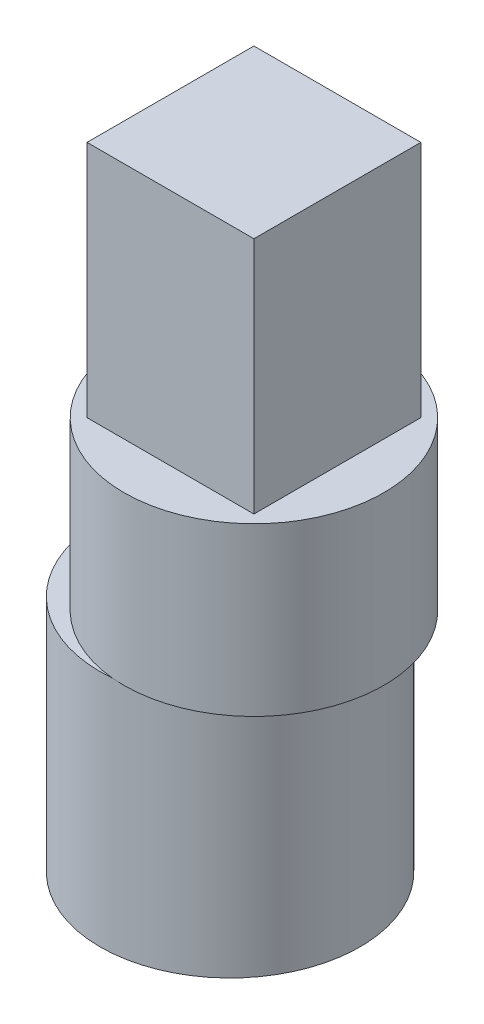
ISO-10303-21;
HEADER;
FILE_DESCRIPTION(('STEP AP214'),'2;1');
FILE_NAME('part.step','',(''),(''),'','','');
FILE_SCHEMA(('AUTOMOTIVE_DESIGN { 1 0 10303 214 1 1 1 1 }'));
ENDSEC;
DATA;
#1=APPLICATION_CONTEXT('core data for automotive mechanical design processes');
#2=APPLICATION_PROTOCOL_DEFINITION('international standard','automotive_design',2000,#1);
#3=PRODUCT_CONTEXT('',#1,'mechanical');
#4=PRODUCT('Part','Part','',(#3));
#5=PRODUCT_RELATED_PRODUCT_CATEGORY('part','',(#4));
#6=PRODUCT_DEFINITION_FORMATION('','',#4);
#7=PRODUCT_DEFINITION_CONTEXT('part definition',#1,'design');
#8=PRODUCT_DEFINITION('design','',#6,#7);
#9=PRODUCT_DEFINITION_SHAPE('','',#8);
#10=(LENGTH_UNIT() NAMED_UNIT(*) SI_UNIT(.MILLI.,.METRE.));
#11=(NAMED_UNIT(*) PLANE_ANGLE_UNIT() SI_UNIT($,.RADIAN.));
#12=(NAMED_UNIT(*) SI_UNIT($,.STERADIAN.) SOLID_ANGLE_UNIT());
#13=UNCERTAINTY_MEASURE_WITH_UNIT(LENGTH_MEASURE(1.E-05),#10,'distance_accuracy_value','');
#14=(GEOMETRIC_REPRESENTATION_CONTEXT(3) GLOBAL_UNCERTAINTY_ASSIGNED_CONTEXT((#13)) GLOBAL_UNIT_ASSIGNED_CONTEXT((#10,
#11,#12)) REPRESENTATION_CONTEXT('',''));
#15=CARTESIAN_POINT('',(0.,0.,0.));
#16=DIRECTION('',(0.,0.,1.));
#17=DIRECTION('',(1.,0.,0.));
#18=AXIS2_PLACEMENT_3D('',#15,#16,#17);
#19=CARTESIAN_POINT('',(0.,7.,0.));
#20=DIRECTION('',(0.,-1.,0.));
#21=DIRECTION('',(0.,0.,-1.));
#22=AXIS2_PLACEMENT_3D('',#19,#20,#21);
#23=CYLINDRICAL_SURFACE('',#22,5.45);
#24=CARTESIAN_POINT('',(0.,7.,0.));
#25=DIRECTION('',(0.,1.,0.));
#26=DIRECTION('',(0.,0.,1.));
#27=AXIS2_PLACEMENT_3D('',#24,#25,#26);
#28=CIRCLE('',#27,5.45);
#29=CARTESIAN_POINT('',(0.,7.,5.45));
#30=VERTEX_POINT('',#29);
#31=EDGE_CURVE('E11',#30,#30,#28,.T.);
#32=ORIENTED_EDGE('',*,*,#31,.F.);
#33=EDGE_LOOP('',(#32));
#34=FACE_BOUND('',#33,.T.);
#35=CARTESIAN_POINT('',(0.,0.,0.));
#36=DIRECTION('',(0.,1.,0.));
#37=DIRECTION('',(0.,0.,1.));
#38=AXIS2_PLACEMENT_3D('',#35,#36,#37);
#39=CIRCLE('',#38,5.45);
#40=CARTESIAN_POINT('',(-0.5,0.,-5.42701575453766));
#41=VERTEX_POINT('',#40);
#42=CARTESIAN_POINT('',(-0.5,0.,5.42701575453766));
#43=VERTEX_POINT('',#42);
#44=EDGE_CURVE('E46',#41,#43,#39,.T.);
#45=ORIENTED_EDGE('',*,*,#44,.T.);
#46=EDGE_CURVE('E127',#43,#41,#39,.T.);
#47=ORIENTED_EDGE('',*,*,#46,.T.);
#48=EDGE_LOOP('',(#45,#47));
#49=FACE_BOUND('',#48,.T.);
#50=ADVANCED_FACE('F43',(#34,#49),#23,.T.);
#51=CARTESIAN_POINT('',(0.,7.,0.));
#52=DIRECTION('',(0.,1.,0.));
#53=DIRECTION('',(0.,0.,1.));
#54=AXIS2_PLACEMENT_3D('',#51,#52,#53);
#55=PLANE('',#54);
#56=DIRECTION('',(0.,0.,1.));
#57=VECTOR('',#56,1.);
#58=CARTESIAN_POINT('',(-3.5,7.,-3.5));
#59=LINE('',#58,#57);
#60=CARTESIAN_POINT('',(-3.5,7.,-3.5));
#61=VERTEX_POINT('',#60);
#62=CARTESIAN_POINT('',(-3.5,7.,3.5));
#63=VERTEX_POINT('',#62);
#64=EDGE_CURVE('E58',#61,#63,#59,.T.);
#65=ORIENTED_EDGE('',*,*,#64,.F.);
#66=DIRECTION('',(-1.,0.,0.));
#67=VECTOR('',#66,1.);
#68=CARTESIAN_POINT('',(-3.5,7.,-3.5));
#69=LINE('',#68,#67);
#70=CARTESIAN_POINT('',(3.5,7.,-3.5));
#71=VERTEX_POINT('',#70);
#72=EDGE_CURVE('E62',#71,#61,#69,.T.);
#73=ORIENTED_EDGE('',*,*,#72,.F.);
#74=DIRECTION('',(0.,0.,-1.));
#75=VECTOR('',#74,1.);
#76=CARTESIAN_POINT('',(3.5,7.,-3.5));
#77=LINE('',#76,#75);
#78=CARTESIAN_POINT('',(3.5,7.,3.5));
#79=VERTEX_POINT('',#78);
#80=EDGE_CURVE('E267',#79,#71,#77,.T.);
#81=ORIENTED_EDGE('',*,*,#80,.F.);
#82=DIRECTION('',(1.,0.,0.));
#83=VECTOR('',#82,1.);
#84=CARTESIAN_POINT('',(-3.5,7.,3.5));
#85=LINE('',#84,#83);
#86=EDGE_CURVE('E277',#63,#79,#85,.T.);
#87=ORIENTED_EDGE('',*,*,#86,.F.);
#88=EDGE_LOOP('',(#65,#73,#81,#87));
#89=FACE_BOUND('',#88,.T.);
#90=ORIENTED_EDGE('',*,*,#31,.T.);
#91=EDGE_LOOP('',(#90));
#92=FACE_BOUND('',#91,.T.);
#93=ADVANCED_FACE('F155',(#89,#92),#55,.T.);
#94=CARTESIAN_POINT('',(0.,0.,0.));
#95=DIRECTION('',(0.,1.,0.));
#96=DIRECTION('',(0.,0.,1.));
#97=AXIS2_PLACEMENT_3D('',#94,#95,#96);
#98=PLANE('',#97);
#99=CARTESIAN_POINT('',(-1.,0.,0.));
#100=DIRECTION('',(0.,-1.,0.));
#101=DIRECTION('',(0.,0.,-1.));
#102=AXIS2_PLACEMENT_3D('',#99,#100,#101);
#103=CIRCLE('',#102,5.45);
#104=EDGE_CURVE('E118',#41,#43,#103,.T.);
#105=ORIENTED_EDGE('',*,*,#104,.F.);
#106=ORIENTED_EDGE('',*,*,#46,.F.);
#107=EDGE_LOOP('',(#105,#106));
#108=FACE_BOUND('',#107,.T.);
#109=ADVANCED_FACE('F136',(#108),#98,.F.);
#110=CARTESIAN_POINT('',(-1.,-10.,0.));
#111=DIRECTION('',(0.,1.,0.));
#112=DIRECTION('',(0.,0.,1.));
#113=AXIS2_PLACEMENT_3D('',#110,#111,#112);
#114=CYLINDRICAL_SURFACE('',#113,5.45);
#115=CARTESIAN_POINT('',(-1.,-10.,0.));
#116=DIRECTION('',(0.,-1.,0.));
#117=DIRECTION('',(0.,0.,-1.));
#118=AXIS2_PLACEMENT_3D('',#115,#116,#117);
#119=CIRCLE('',#118,5.45);
#120=CARTESIAN_POINT('',(-1.,-10.,-5.45));
#121=VERTEX_POINT('',#120);
#122=EDGE_CURVE('E124',#121,#121,#119,.T.);
#123=ORIENTED_EDGE('',*,*,#122,.F.);
#124=EDGE_LOOP('',(#123));
#125=FACE_BOUND('',#124,.T.);
#126=ORIENTED_EDGE('',*,*,#104,.T.);
#127=EDGE_CURVE('E113',#43,#41,#103,.T.);
#128=ORIENTED_EDGE('',*,*,#127,.T.);
#129=EDGE_LOOP('',(#126,#128));
#130=FACE_BOUND('',#129,.T.);
#131=ADVANCED_FACE('F131',(#125,#130),#114,.T.);
#132=CARTESIAN_POINT('',(-1.,-10.,0.));
#133=DIRECTION('',(0.,-1.,0.));
#134=DIRECTION('',(0.,0.,-1.));
#135=AXIS2_PLACEMENT_3D('',#132,#133,#134);
#136=PLANE('',#135);
#137=ORIENTED_EDGE('',*,*,#122,.T.);
#138=EDGE_LOOP('',(#137));
#139=FACE_BOUND('',#138,.T.);
#140=ADVANCED_FACE('F144',(#139),#136,.T.);
#141=CARTESIAN_POINT('',(-1.,0.,0.));
#142=DIRECTION('',(0.,-1.,0.));
#143=DIRECTION('',(0.,0.,-1.));
#144=AXIS2_PLACEMENT_3D('',#141,#142,#143);
#145=PLANE('',#144);
#146=ORIENTED_EDGE('',*,*,#44,.F.);
#147=ORIENTED_EDGE('',*,*,#127,.F.);
#148=EDGE_LOOP('',(#146,#147));
#149=FACE_BOUND('',#148,.T.);
#150=ADVANCED_FACE('F141',(#149),#145,.F.);
#151=CARTESIAN_POINT('',(-3.5,17.,-3.5));
#152=DIRECTION('',(1.,0.,0.));
#153=DIRECTION('',(0.,0.,-1.));
#154=AXIS2_PLACEMENT_3D('',#151,#152,#153);
#155=PLANE('',#154);
#156=ORIENTED_EDGE('',*,*,#64,.T.);
#157=DIRECTION('',(0.,-1.,0.));
#158=VECTOR('',#157,1.);
#159=CARTESIAN_POINT('',(-3.5,17.,3.5));
#160=LINE('',#159,#158);
#161=CARTESIAN_POINT('',(-3.5,17.,3.5));
#162=VERTEX_POINT('',#161);
#163=EDGE_CURVE('E93',#162,#63,#160,.T.);
#164=ORIENTED_EDGE('',*,*,#163,.F.);
#165=DIRECTION('',(0.,0.,1.));
#166=VECTOR('',#165,1.);
#167=CARTESIAN_POINT('',(-3.5,17.,-3.5));
#168=LINE('',#167,#166);
#169=CARTESIAN_POINT('',(-3.5,17.,-3.5));
#170=VERTEX_POINT('',#169);
#171=EDGE_CURVE('E100',#170,#162,#168,.T.);
#172=ORIENTED_EDGE('',*,*,#171,.F.);
#173=DIRECTION('',(0.,-1.,0.));
#174=VECTOR('',#173,1.);
#175=CARTESIAN_POINT('',(-3.5,17.,-3.5));
#176=LINE('',#175,#174);
#177=EDGE_CURVE('E264',#170,#61,#176,.T.);
#178=ORIENTED_EDGE('',*,*,#177,.T.);
#179=EDGE_LOOP('',(#156,#164,#172,#178));
#180=FACE_BOUND('',#179,.T.);
#181=ADVANCED_FACE('F111',(#180),#155,.F.);
#182=CARTESIAN_POINT('',(-3.5,17.,3.5));
#183=DIRECTION('',(0.,0.,-1.));
#184=DIRECTION('',(-1.,0.,0.));
#185=AXIS2_PLACEMENT_3D('',#182,#183,#184);
#186=PLANE('',#185);
#187=ORIENTED_EDGE('',*,*,#86,.T.);
#188=DIRECTION('',(0.,-1.,0.));
#189=VECTOR('',#188,1.);
#190=CARTESIAN_POINT('',(3.5,17.,3.5));
#191=LINE('',#190,#189);
#192=CARTESIAN_POINT('',(3.5,17.,3.5));
#193=VERTEX_POINT('',#192);
#194=EDGE_CURVE('E95',#193,#79,#191,.T.);
#195=ORIENTED_EDGE('',*,*,#194,.F.);
#196=DIRECTION('',(1.,0.,0.));
#197=VECTOR('',#196,1.);
#198=CARTESIAN_POINT('',(-3.5,17.,3.5));
#199=LINE('',#198,#197);
#200=EDGE_CURVE('E88',#162,#193,#199,.T.);
#201=ORIENTED_EDGE('',*,*,#200,.F.);
#202=ORIENTED_EDGE('',*,*,#163,.T.);
#203=EDGE_LOOP('',(#187,#195,#201,#202));
#204=FACE_BOUND('',#203,.T.);
#205=ADVANCED_FACE('F91',(#204),#186,.F.);
#206=CARTESIAN_POINT('',(3.5,17.,-3.5));
#207=DIRECTION('',(-1.,0.,0.));
#208=DIRECTION('',(0.,0.,1.));
#209=AXIS2_PLACEMENT_3D('',#206,#207,#208);
#210=PLANE('',#209);
#211=ORIENTED_EDGE('',*,*,#80,.T.);
#212=DIRECTION('',(0.,-1.,0.));
#213=VECTOR('',#212,1.);
#214=CARTESIAN_POINT('',(3.5,17.,-3.5));
#215=LINE('',#214,#213);
#216=CARTESIAN_POINT('',(3.5,17.,-3.5));
#217=VERTEX_POINT('',#216);
#218=EDGE_CURVE('E120',#217,#71,#215,.T.);
#219=ORIENTED_EDGE('',*,*,#218,.F.);
#220=DIRECTION('',(0.,0.,-1.));
#221=VECTOR('',#220,1.);
#222=CARTESIAN_POINT('',(3.5,17.,-3.5));
#223=LINE('',#222,#221);
#224=EDGE_CURVE('E99',#193,#217,#223,.T.);
#225=ORIENTED_EDGE('',*,*,#224,.F.);
#226=ORIENTED_EDGE('',*,*,#194,.T.);
#227=EDGE_LOOP('',(#211,#219,#225,#226));
#228=FACE_BOUND('',#227,.T.);
#229=ADVANCED_FACE('F206',(#228),#210,.F.);
#230=CARTESIAN_POINT('',(-3.5,17.,-3.5));
#231=DIRECTION('',(0.,0.,1.));
#232=DIRECTION('',(1.,0.,0.));
#233=AXIS2_PLACEMENT_3D('',#230,#231,#232);
#234=PLANE('',#233);
#235=ORIENTED_EDGE('',*,*,#72,.T.);
#236=ORIENTED_EDGE('',*,*,#177,.F.);
#237=DIRECTION('',(-1.,0.,0.));
#238=VECTOR('',#237,1.);
#239=CARTESIAN_POINT('',(-3.5,17.,-3.5));
#240=LINE('',#239,#238);
#241=EDGE_CURVE('E105',#217,#170,#240,.T.);
#242=ORIENTED_EDGE('',*,*,#241,.F.);
#243=ORIENTED_EDGE('',*,*,#218,.T.);
#244=EDGE_LOOP('',(#235,#236,#242,#243));
#245=FACE_BOUND('',#244,.T.);
#246=ADVANCED_FACE('F216',(#245),#234,.F.);
#247=CARTESIAN_POINT('',(0.,17.,0.));
#248=DIRECTION('',(0.,1.,0.));
#249=DIRECTION('',(0.,0.,1.));
#250=AXIS2_PLACEMENT_3D('',#247,#248,#249);
#251=PLANE('',#250);
#252=ORIENTED_EDGE('',*,*,#171,.T.);
#253=ORIENTED_EDGE('',*,*,#200,.T.);
#254=ORIENTED_EDGE('',*,*,#224,.T.);
#255=ORIENTED_EDGE('',*,*,#241,.T.);
#256=EDGE_LOOP('',(#252,#253,#254,#255));
#257=FACE_BOUND('',#256,.T.);
#258=ADVANCED_FACE('F103',(#257),#251,.T.);
#259=CLOSED_SHELL('',(#50,#93,#109,#131,#140,#150,#181,#205,#229,#246,#258));
#260=MANIFOLD_SOLID_BREP('B2',#259);
#261=ADVANCED_BREP_SHAPE_REPRESENTATION('',(#18,#260),#14);
#262=SHAPE_DEFINITION_REPRESENTATION(#9,#261);
ENDSEC;
END-ISO-10303-21;
